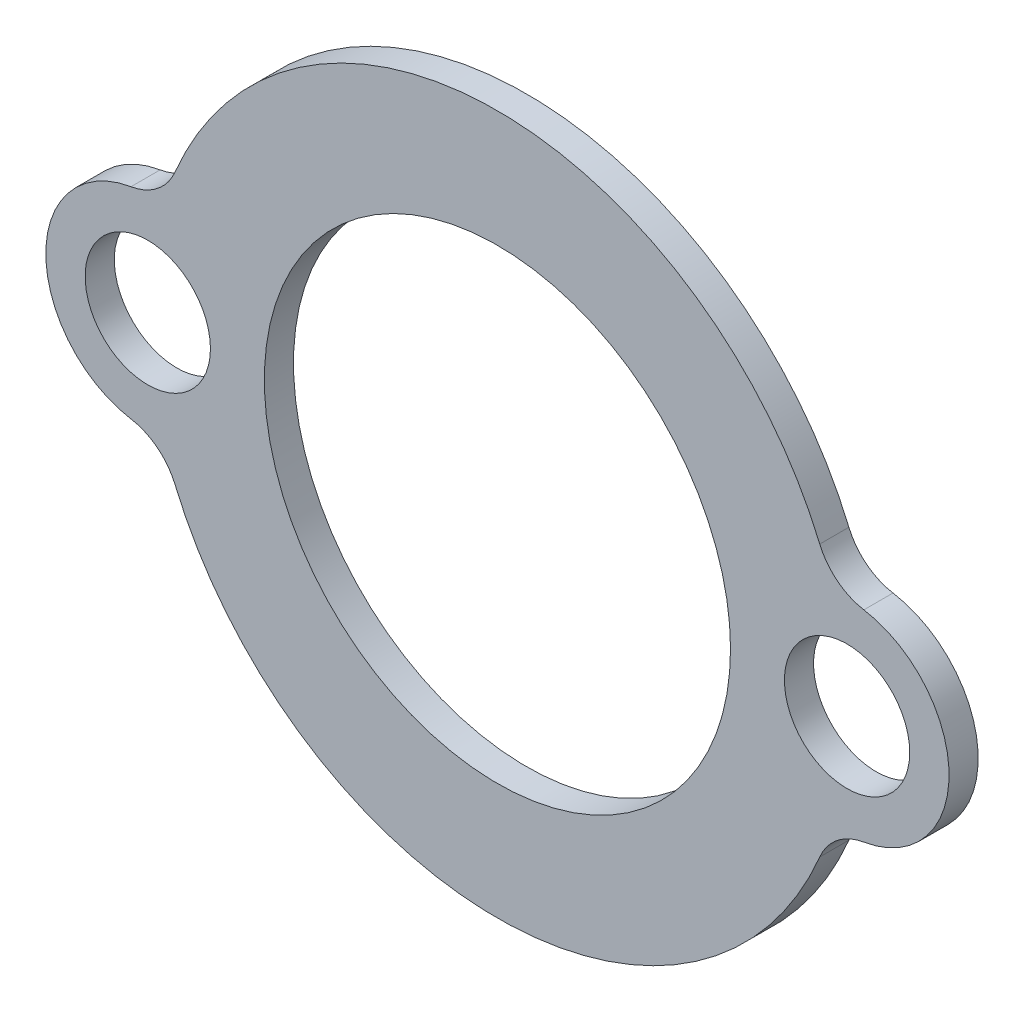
ISO-10303-21;
HEADER;
FILE_DESCRIPTION(('STEP AP214'),'2;1');
FILE_NAME('part.step','',(''),(''),'','','');
FILE_SCHEMA(('AUTOMOTIVE_DESIGN { 1 0 10303 214 1 1 1 1 }'));
ENDSEC;
DATA;
#1=APPLICATION_CONTEXT('core data for automotive mechanical design processes');
#2=APPLICATION_PROTOCOL_DEFINITION('international standard','automotive_design',2000,#1);
#3=PRODUCT_CONTEXT('',#1,'mechanical');
#4=PRODUCT('Part','Part','',(#3));
#5=PRODUCT_RELATED_PRODUCT_CATEGORY('part','',(#4));
#6=PRODUCT_DEFINITION_FORMATION('','',#4);
#7=PRODUCT_DEFINITION_CONTEXT('part definition',#1,'design');
#8=PRODUCT_DEFINITION('design','',#6,#7);
#9=PRODUCT_DEFINITION_SHAPE('','',#8);
#10=(LENGTH_UNIT() NAMED_UNIT(*) SI_UNIT(.MILLI.,.METRE.));
#11=(NAMED_UNIT(*) PLANE_ANGLE_UNIT() SI_UNIT($,.RADIAN.));
#12=(NAMED_UNIT(*) SI_UNIT($,.STERADIAN.) SOLID_ANGLE_UNIT());
#13=UNCERTAINTY_MEASURE_WITH_UNIT(LENGTH_MEASURE(1.E-05),#10,'distance_accuracy_value','');
#14=(GEOMETRIC_REPRESENTATION_CONTEXT(3) GLOBAL_UNCERTAINTY_ASSIGNED_CONTEXT((#13)) GLOBAL_UNIT_ASSIGNED_CONTEXT((#10,
#11,#12)) REPRESENTATION_CONTEXT('',''));
#15=CARTESIAN_POINT('',(0.,0.,0.));
#16=DIRECTION('',(0.,0.,1.));
#17=DIRECTION('',(1.,0.,0.));
#18=AXIS2_PLACEMENT_3D('',#15,#16,#17);
#19=CARTESIAN_POINT('',(-6.,0.,1.));
#20=DIRECTION('',(0.,0.,1.));
#21=DIRECTION('',(1.,0.,0.));
#22=AXIS2_PLACEMENT_3D('',#19,#20,#21);
#23=PLANE('',#22);
#24=CARTESIAN_POINT('',(12.,0.,1.));
#25=DIRECTION('',(0.,0.,1.));
#26=DIRECTION('',(1.,0.,0.));
#27=AXIS2_PLACEMENT_3D('',#24,#25,#26);
#28=CIRCLE('',#27,2.15);
#29=CARTESIAN_POINT('',(14.15,0.,1.));
#30=VERTEX_POINT('',#29);
#31=EDGE_CURVE('E185',#30,#30,#28,.T.);
#32=ORIENTED_EDGE('',*,*,#31,.F.);
#33=EDGE_LOOP('',(#32));
#34=FACE_BOUND('',#33,.T.);
#35=CARTESIAN_POINT('',(12.,0.,1.));
#36=DIRECTION('',(0.,0.,1.));
#37=DIRECTION('',(1.,0.,0.));
#38=AXIS2_PLACEMENT_3D('',#35,#36,#37);
#39=CIRCLE('',#38,3.5);
#40=CARTESIAN_POINT('',(12.5767045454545,-3.45216046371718,1.));
#41=VERTEX_POINT('',#40);
#42=CARTESIAN_POINT('',(12.5767045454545,3.45216046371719,1.));
#43=VERTEX_POINT('',#42);
#44=EDGE_CURVE('E120',#41,#43,#39,.T.);
#45=ORIENTED_EDGE('',*,*,#44,.T.);
#46=CARTESIAN_POINT('',(12.90625,5.4248235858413,1.));
#47=DIRECTION('',(0.,0.,1.));
#48=DIRECTION('',(1.,0.,0.));
#49=AXIS2_PLACEMENT_3D('',#46,#47,#48);
#50=CIRCLE('',#49,2.);
#51=CARTESIAN_POINT('',(11.0625,4.64984878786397,1.));
#52=VERTEX_POINT('',#51);
#53=EDGE_CURVE('E11',#43,#52,#50,.F.);
#54=ORIENTED_EDGE('',*,*,#53,.T.);
#55=CARTESIAN_POINT('',(0.,0.,1.));
#56=DIRECTION('',(0.,0.,1.));
#57=DIRECTION('',(1.,0.,0.));
#58=AXIS2_PLACEMENT_3D('',#55,#56,#57);
#59=CIRCLE('',#58,12.);
#60=CARTESIAN_POINT('',(-11.0625,4.64984878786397,1.));
#61=VERTEX_POINT('',#60);
#62=EDGE_CURVE('E127',#52,#61,#59,.T.);
#63=ORIENTED_EDGE('',*,*,#62,.T.);
#64=CARTESIAN_POINT('',(-12.90625,5.42482358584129,1.));
#65=DIRECTION('',(0.,0.,1.));
#66=DIRECTION('',(1.,0.,0.));
#67=AXIS2_PLACEMENT_3D('',#64,#65,#66);
#68=CIRCLE('',#67,2.);
#69=CARTESIAN_POINT('',(-12.5767045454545,3.45216046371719,1.));
#70=VERTEX_POINT('',#69);
#71=EDGE_CURVE('E156',#61,#70,#68,.F.);
#72=ORIENTED_EDGE('',*,*,#71,.T.);
#73=CARTESIAN_POINT('',(-12.,0.,1.));
#74=DIRECTION('',(0.,0.,1.));
#75=DIRECTION('',(1.,0.,0.));
#76=AXIS2_PLACEMENT_3D('',#73,#74,#75);
#77=CIRCLE('',#76,3.5);
#78=CARTESIAN_POINT('',(-12.5767045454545,-3.45216046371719,1.));
#79=VERTEX_POINT('',#78);
#80=EDGE_CURVE('E130',#70,#79,#77,.T.);
#81=ORIENTED_EDGE('',*,*,#80,.T.);
#82=CARTESIAN_POINT('',(-12.90625,-5.42482358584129,1.));
#83=DIRECTION('',(0.,0.,1.));
#84=DIRECTION('',(1.,0.,0.));
#85=AXIS2_PLACEMENT_3D('',#82,#83,#84);
#86=CIRCLE('',#85,2.);
#87=CARTESIAN_POINT('',(-11.0625,-4.64984878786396,1.));
#88=VERTEX_POINT('',#87);
#89=EDGE_CURVE('E152',#79,#88,#86,.F.);
#90=ORIENTED_EDGE('',*,*,#89,.T.);
#91=CARTESIAN_POINT('',(0.,0.,1.));
#92=DIRECTION('',(0.,0.,1.));
#93=DIRECTION('',(1.,0.,0.));
#94=AXIS2_PLACEMENT_3D('',#91,#92,#93);
#95=CIRCLE('',#94,12.);
#96=CARTESIAN_POINT('',(11.0625,-4.64984878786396,1.));
#97=VERTEX_POINT('',#96);
#98=EDGE_CURVE('E169',#88,#97,#95,.T.);
#99=ORIENTED_EDGE('',*,*,#98,.T.);
#100=CARTESIAN_POINT('',(12.90625,-5.42482358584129,1.));
#101=DIRECTION('',(0.,0.,1.));
#102=DIRECTION('',(1.,0.,0.));
#103=AXIS2_PLACEMENT_3D('',#100,#101,#102);
#104=CIRCLE('',#103,2.);
#105=EDGE_CURVE('E112',#97,#41,#104,.F.);
#106=ORIENTED_EDGE('',*,*,#105,.T.);
#107=EDGE_LOOP('',(#45,#54,#63,#72,#81,#90,#99,#106));
#108=FACE_BOUND('',#107,.T.);
#109=CARTESIAN_POINT('',(0.,0.,1.));
#110=DIRECTION('',(0.,0.,1.));
#111=DIRECTION('',(1.,0.,0.));
#112=AXIS2_PLACEMENT_3D('',#109,#110,#111);
#113=CIRCLE('',#112,8.);
#114=CARTESIAN_POINT('',(8.,0.,1.));
#115=VERTEX_POINT('',#114);
#116=EDGE_CURVE('E175',#115,#115,#113,.T.);
#117=ORIENTED_EDGE('',*,*,#116,.F.);
#118=EDGE_LOOP('',(#117));
#119=FACE_BOUND('',#118,.T.);
#120=CARTESIAN_POINT('',(-12.,0.,1.));
#121=DIRECTION('',(0.,0.,1.));
#122=DIRECTION('',(1.,0.,0.));
#123=AXIS2_PLACEMENT_3D('',#120,#121,#122);
#124=CIRCLE('',#123,2.15);
#125=CARTESIAN_POINT('',(-9.85,0.,1.));
#126=VERTEX_POINT('',#125);
#127=EDGE_CURVE('E190',#126,#126,#124,.T.);
#128=ORIENTED_EDGE('',*,*,#127,.F.);
#129=EDGE_LOOP('',(#128));
#130=FACE_BOUND('',#129,.T.);
#131=ADVANCED_FACE('F37',(#34,#108,#119,#130),#23,.T.);
#132=CARTESIAN_POINT('',(-6.,0.,0.));
#133=DIRECTION('',(0.,0.,1.));
#134=DIRECTION('',(1.,0.,0.));
#135=AXIS2_PLACEMENT_3D('',#132,#133,#134);
#136=PLANE('',#135);
#137=CARTESIAN_POINT('',(0.,0.,0.));
#138=DIRECTION('',(0.,0.,1.));
#139=DIRECTION('',(1.,0.,0.));
#140=AXIS2_PLACEMENT_3D('',#137,#138,#139);
#141=CIRCLE('',#140,12.);
#142=CARTESIAN_POINT('',(11.0625,4.64984878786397,0.));
#143=VERTEX_POINT('',#142);
#144=CARTESIAN_POINT('',(-11.0625,4.64984878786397,0.));
#145=VERTEX_POINT('',#144);
#146=EDGE_CURVE('E172',#143,#145,#141,.T.);
#147=ORIENTED_EDGE('',*,*,#146,.F.);
#148=CARTESIAN_POINT('',(12.90625,5.4248235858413,0.));
#149=DIRECTION('',(0.,0.,1.));
#150=DIRECTION('',(1.,0.,0.));
#151=AXIS2_PLACEMENT_3D('',#148,#149,#150);
#152=CIRCLE('',#151,2.);
#153=CARTESIAN_POINT('',(12.5767045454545,3.45216046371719,0.));
#154=VERTEX_POINT('',#153);
#155=EDGE_CURVE('E45',#143,#154,#152,.T.);
#156=ORIENTED_EDGE('',*,*,#155,.T.);
#157=CARTESIAN_POINT('',(12.,0.,0.));
#158=DIRECTION('',(0.,0.,1.));
#159=DIRECTION('',(1.,0.,0.));
#160=AXIS2_PLACEMENT_3D('',#157,#158,#159);
#161=CIRCLE('',#160,3.5);
#162=CARTESIAN_POINT('',(12.5767045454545,-3.45216046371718,0.));
#163=VERTEX_POINT('',#162);
#164=EDGE_CURVE('E118',#163,#154,#161,.T.);
#165=ORIENTED_EDGE('',*,*,#164,.F.);
#166=CARTESIAN_POINT('',(12.90625,-5.42482358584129,0.));
#167=DIRECTION('',(0.,0.,1.));
#168=DIRECTION('',(1.,0.,0.));
#169=AXIS2_PLACEMENT_3D('',#166,#167,#168);
#170=CIRCLE('',#169,2.);
#171=CARTESIAN_POINT('',(11.0625,-4.64984878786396,0.));
#172=VERTEX_POINT('',#171);
#173=EDGE_CURVE('E102',#163,#172,#170,.T.);
#174=ORIENTED_EDGE('',*,*,#173,.T.);
#175=CARTESIAN_POINT('',(0.,0.,0.));
#176=DIRECTION('',(0.,0.,1.));
#177=DIRECTION('',(1.,0.,0.));
#178=AXIS2_PLACEMENT_3D('',#175,#176,#177);
#179=CIRCLE('',#178,12.);
#180=CARTESIAN_POINT('',(-11.0625,-4.64984878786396,0.));
#181=VERTEX_POINT('',#180);
#182=EDGE_CURVE('E128',#181,#172,#179,.T.);
#183=ORIENTED_EDGE('',*,*,#182,.F.);
#184=CARTESIAN_POINT('',(-12.90625,-5.42482358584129,0.));
#185=DIRECTION('',(0.,0.,1.));
#186=DIRECTION('',(1.,0.,0.));
#187=AXIS2_PLACEMENT_3D('',#184,#185,#186);
#188=CIRCLE('',#187,2.);
#189=CARTESIAN_POINT('',(-12.5767045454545,-3.45216046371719,0.));
#190=VERTEX_POINT('',#189);
#191=EDGE_CURVE('E150',#181,#190,#188,.T.);
#192=ORIENTED_EDGE('',*,*,#191,.T.);
#193=CARTESIAN_POINT('',(-12.,0.,0.));
#194=DIRECTION('',(0.,0.,1.));
#195=DIRECTION('',(1.,0.,0.));
#196=AXIS2_PLACEMENT_3D('',#193,#194,#195);
#197=CIRCLE('',#196,3.5);
#198=CARTESIAN_POINT('',(-12.5767045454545,3.45216046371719,0.));
#199=VERTEX_POINT('',#198);
#200=EDGE_CURVE('E132',#199,#190,#197,.T.);
#201=ORIENTED_EDGE('',*,*,#200,.F.);
#202=CARTESIAN_POINT('',(-12.90625,5.42482358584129,0.));
#203=DIRECTION('',(0.,0.,1.));
#204=DIRECTION('',(1.,0.,0.));
#205=AXIS2_PLACEMENT_3D('',#202,#203,#204);
#206=CIRCLE('',#205,2.);
#207=EDGE_CURVE('E154',#199,#145,#206,.T.);
#208=ORIENTED_EDGE('',*,*,#207,.T.);
#209=EDGE_LOOP('',(#147,#156,#165,#174,#183,#192,#201,#208));
#210=FACE_BOUND('',#209,.T.);
#211=CARTESIAN_POINT('',(0.,0.,0.));
#212=DIRECTION('',(0.,0.,1.));
#213=DIRECTION('',(1.,0.,0.));
#214=AXIS2_PLACEMENT_3D('',#211,#212,#213);
#215=CIRCLE('',#214,8.);
#216=CARTESIAN_POINT('',(8.,0.,0.));
#217=VERTEX_POINT('',#216);
#218=EDGE_CURVE('E178',#217,#217,#215,.T.);
#219=ORIENTED_EDGE('',*,*,#218,.T.);
#220=EDGE_LOOP('',(#219));
#221=FACE_BOUND('',#220,.T.);
#222=CARTESIAN_POINT('',(12.,0.,0.));
#223=DIRECTION('',(0.,0.,1.));
#224=DIRECTION('',(1.,0.,0.));
#225=AXIS2_PLACEMENT_3D('',#222,#223,#224);
#226=CIRCLE('',#225,2.15);
#227=CARTESIAN_POINT('',(14.15,0.,0.));
#228=VERTEX_POINT('',#227);
#229=EDGE_CURVE('E187',#228,#228,#226,.T.);
#230=ORIENTED_EDGE('',*,*,#229,.T.);
#231=EDGE_LOOP('',(#230));
#232=FACE_BOUND('',#231,.T.);
#233=CARTESIAN_POINT('',(-12.,0.,0.));
#234=DIRECTION('',(0.,0.,1.));
#235=DIRECTION('',(1.,0.,0.));
#236=AXIS2_PLACEMENT_3D('',#233,#234,#235);
#237=CIRCLE('',#236,2.15);
#238=CARTESIAN_POINT('',(-9.85,0.,0.));
#239=VERTEX_POINT('',#238);
#240=EDGE_CURVE('E193',#239,#239,#237,.T.);
#241=ORIENTED_EDGE('',*,*,#240,.T.);
#242=EDGE_LOOP('',(#241));
#243=FACE_BOUND('',#242,.T.);
#244=ADVANCED_FACE('F125',(#210,#221,#232,#243),#136,.F.);
#245=CARTESIAN_POINT('',(0.,0.,1.));
#246=DIRECTION('',(0.,0.,-1.));
#247=DIRECTION('',(-1.,0.,0.));
#248=AXIS2_PLACEMENT_3D('',#245,#246,#247);
#249=CYLINDRICAL_SURFACE('',#248,12.);
#250=ORIENTED_EDGE('',*,*,#146,.T.);
#251=DIRECTION('',(0.,0.,-1.));
#252=VECTOR('',#251,1.);
#253=CARTESIAN_POINT('',(-11.0625,4.64984878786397,1.));
#254=LINE('',#253,#252);
#255=EDGE_CURVE('E52',#145,#61,#254,.F.);
#256=ORIENTED_EDGE('',*,*,#255,.T.);
#257=ORIENTED_EDGE('',*,*,#62,.F.);
#258=DIRECTION('',(0.,0.,-1.));
#259=VECTOR('',#258,1.);
#260=CARTESIAN_POINT('',(11.0625,4.64984878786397,1.));
#261=LINE('',#260,#259);
#262=EDGE_CURVE('E145',#52,#143,#261,.T.);
#263=ORIENTED_EDGE('',*,*,#262,.T.);
#264=EDGE_LOOP('',(#250,#256,#257,#263));
#265=FACE_BOUND('',#264,.T.);
#266=ADVANCED_FACE('F173',(#265),#249,.T.);
#267=CARTESIAN_POINT('',(-12.,0.,1.));
#268=DIRECTION('',(0.,0.,-1.));
#269=DIRECTION('',(-1.,0.,0.));
#270=AXIS2_PLACEMENT_3D('',#267,#268,#269);
#271=CYLINDRICAL_SURFACE('',#270,3.5);
#272=ORIENTED_EDGE('',*,*,#200,.T.);
#273=DIRECTION('',(0.,0.,-1.));
#274=VECTOR('',#273,1.);
#275=CARTESIAN_POINT('',(-12.5767045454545,-3.45216046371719,1.));
#276=LINE('',#275,#274);
#277=EDGE_CURVE('E143',#190,#79,#276,.F.);
#278=ORIENTED_EDGE('',*,*,#277,.T.);
#279=ORIENTED_EDGE('',*,*,#80,.F.);
#280=DIRECTION('',(0.,0.,-1.));
#281=VECTOR('',#280,1.);
#282=CARTESIAN_POINT('',(-12.5767045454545,3.45216046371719,1.));
#283=LINE('',#282,#281);
#284=EDGE_CURVE('E140',#70,#199,#283,.T.);
#285=ORIENTED_EDGE('',*,*,#284,.T.);
#286=EDGE_LOOP('',(#272,#278,#279,#285));
#287=FACE_BOUND('',#286,.T.);
#288=ADVANCED_FACE('F166',(#287),#271,.T.);
#289=CARTESIAN_POINT('',(0.,0.,1.));
#290=DIRECTION('',(0.,0.,-1.));
#291=DIRECTION('',(-1.,0.,0.));
#292=AXIS2_PLACEMENT_3D('',#289,#290,#291);
#293=CYLINDRICAL_SURFACE('',#292,12.);
#294=ORIENTED_EDGE('',*,*,#182,.T.);
#295=DIRECTION('',(0.,0.,-1.));
#296=VECTOR('',#295,1.);
#297=CARTESIAN_POINT('',(11.0625,-4.64984878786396,1.));
#298=LINE('',#297,#296);
#299=EDGE_CURVE('E107',#172,#97,#298,.F.);
#300=ORIENTED_EDGE('',*,*,#299,.T.);
#301=ORIENTED_EDGE('',*,*,#98,.F.);
#302=DIRECTION('',(0.,0.,-1.));
#303=VECTOR('',#302,1.);
#304=CARTESIAN_POINT('',(-11.0625,-4.64984878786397,1.));
#305=LINE('',#304,#303);
#306=EDGE_CURVE('E121',#88,#181,#305,.T.);
#307=ORIENTED_EDGE('',*,*,#306,.T.);
#308=EDGE_LOOP('',(#294,#300,#301,#307));
#309=FACE_BOUND('',#308,.T.);
#310=ADVANCED_FACE('F216',(#309),#293,.T.);
#311=CARTESIAN_POINT('',(12.,0.,1.));
#312=DIRECTION('',(0.,0.,-1.));
#313=DIRECTION('',(-1.,0.,0.));
#314=AXIS2_PLACEMENT_3D('',#311,#312,#313);
#315=CYLINDRICAL_SURFACE('',#314,3.5);
#316=ORIENTED_EDGE('',*,*,#44,.F.);
#317=DIRECTION('',(0.,0.,-1.));
#318=VECTOR('',#317,1.);
#319=CARTESIAN_POINT('',(12.5767045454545,-3.45216046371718,1.));
#320=LINE('',#319,#318);
#321=EDGE_CURVE('E106',#41,#163,#320,.T.);
#322=ORIENTED_EDGE('',*,*,#321,.T.);
#323=ORIENTED_EDGE('',*,*,#164,.T.);
#324=DIRECTION('',(0.,0.,-1.));
#325=VECTOR('',#324,1.);
#326=CARTESIAN_POINT('',(12.5767045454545,3.45216046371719,1.));
#327=LINE('',#326,#325);
#328=EDGE_CURVE('E122',#154,#43,#327,.F.);
#329=ORIENTED_EDGE('',*,*,#328,.T.);
#330=EDGE_LOOP('',(#316,#322,#323,#329));
#331=FACE_BOUND('',#330,.T.);
#332=ADVANCED_FACE('F117',(#331),#315,.T.);
#333=CARTESIAN_POINT('',(0.,0.,1.));
#334=DIRECTION('',(0.,0.,-1.));
#335=DIRECTION('',(-1.,0.,0.));
#336=AXIS2_PLACEMENT_3D('',#333,#334,#335);
#337=CYLINDRICAL_SURFACE('',#336,8.);
#338=ORIENTED_EDGE('',*,*,#116,.T.);
#339=EDGE_LOOP('',(#338));
#340=FACE_BOUND('',#339,.T.);
#341=ORIENTED_EDGE('',*,*,#218,.F.);
#342=EDGE_LOOP('',(#341));
#343=FACE_BOUND('',#342,.T.);
#344=ADVANCED_FACE('F211',(#340,#343),#337,.F.);
#345=CARTESIAN_POINT('',(12.,0.,1.));
#346=DIRECTION('',(0.,0.,-1.));
#347=DIRECTION('',(-1.,0.,0.));
#348=AXIS2_PLACEMENT_3D('',#345,#346,#347);
#349=CYLINDRICAL_SURFACE('',#348,2.15);
#350=ORIENTED_EDGE('',*,*,#31,.T.);
#351=EDGE_LOOP('',(#350));
#352=FACE_BOUND('',#351,.T.);
#353=ORIENTED_EDGE('',*,*,#229,.F.);
#354=EDGE_LOOP('',(#353));
#355=FACE_BOUND('',#354,.T.);
#356=ADVANCED_FACE('F299',(#352,#355),#349,.F.);
#357=CARTESIAN_POINT('',(-12.,0.,1.));
#358=DIRECTION('',(0.,0.,-1.));
#359=DIRECTION('',(-1.,0.,0.));
#360=AXIS2_PLACEMENT_3D('',#357,#358,#359);
#361=CYLINDRICAL_SURFACE('',#360,2.15);
#362=ORIENTED_EDGE('',*,*,#127,.T.);
#363=EDGE_LOOP('',(#362));
#364=FACE_BOUND('',#363,.T.);
#365=ORIENTED_EDGE('',*,*,#240,.F.);
#366=EDGE_LOOP('',(#365));
#367=FACE_BOUND('',#366,.T.);
#368=ADVANCED_FACE('F199',(#364,#367),#361,.F.);
#369=CARTESIAN_POINT('',(12.90625,-5.42482358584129,1.));
#370=DIRECTION('',(0.,0.,1.));
#371=DIRECTION('',(1.,0.,0.));
#372=AXIS2_PLACEMENT_3D('',#369,#370,#371);
#373=CYLINDRICAL_SURFACE('',#372,2.);
#374=ORIENTED_EDGE('',*,*,#105,.F.);
#375=ORIENTED_EDGE('',*,*,#299,.F.);
#376=ORIENTED_EDGE('',*,*,#173,.F.);
#377=ORIENTED_EDGE('',*,*,#321,.F.);
#378=EDGE_LOOP('',(#374,#375,#376,#377));
#379=FACE_BOUND('',#378,.T.);
#380=ADVANCED_FACE('F105',(#379),#373,.F.);
#381=CARTESIAN_POINT('',(-12.90625,-5.42482358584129,1.));
#382=DIRECTION('',(0.,0.,1.));
#383=DIRECTION('',(1.,0.,0.));
#384=AXIS2_PLACEMENT_3D('',#381,#382,#383);
#385=CYLINDRICAL_SURFACE('',#384,2.);
#386=ORIENTED_EDGE('',*,*,#89,.F.);
#387=ORIENTED_EDGE('',*,*,#277,.F.);
#388=ORIENTED_EDGE('',*,*,#191,.F.);
#389=ORIENTED_EDGE('',*,*,#306,.F.);
#390=EDGE_LOOP('',(#386,#387,#388,#389));
#391=FACE_BOUND('',#390,.T.);
#392=ADVANCED_FACE('F226',(#391),#385,.F.);
#393=CARTESIAN_POINT('',(-12.90625,5.42482358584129,1.));
#394=DIRECTION('',(0.,0.,1.));
#395=DIRECTION('',(1.,0.,0.));
#396=AXIS2_PLACEMENT_3D('',#393,#394,#395);
#397=CYLINDRICAL_SURFACE('',#396,2.);
#398=ORIENTED_EDGE('',*,*,#71,.F.);
#399=ORIENTED_EDGE('',*,*,#255,.F.);
#400=ORIENTED_EDGE('',*,*,#207,.F.);
#401=ORIENTED_EDGE('',*,*,#284,.F.);
#402=EDGE_LOOP('',(#398,#399,#400,#401));
#403=FACE_BOUND('',#402,.T.);
#404=ADVANCED_FACE('F171',(#403),#397,.F.);
#405=CARTESIAN_POINT('',(12.90625,5.4248235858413,1.));
#406=DIRECTION('',(0.,0.,1.));
#407=DIRECTION('',(1.,0.,0.));
#408=AXIS2_PLACEMENT_3D('',#405,#406,#407);
#409=CYLINDRICAL_SURFACE('',#408,2.);
#410=ORIENTED_EDGE('',*,*,#53,.F.);
#411=ORIENTED_EDGE('',*,*,#328,.F.);
#412=ORIENTED_EDGE('',*,*,#155,.F.);
#413=ORIENTED_EDGE('',*,*,#262,.F.);
#414=EDGE_LOOP('',(#410,#411,#412,#413));
#415=FACE_BOUND('',#414,.T.);
#416=ADVANCED_FACE('F39',(#415),#409,.F.);
#417=CLOSED_SHELL('',(#131,#244,#266,#288,#310,#332,#344,#356,#368,#380,#392,#404,#416));
#418=MANIFOLD_SOLID_BREP('B2',#417);
#419=ADVANCED_BREP_SHAPE_REPRESENTATION('',(#18,#418),#14);
#420=SHAPE_DEFINITION_REPRESENTATION(#9,#419);
ENDSEC;
END-ISO-10303-21;
